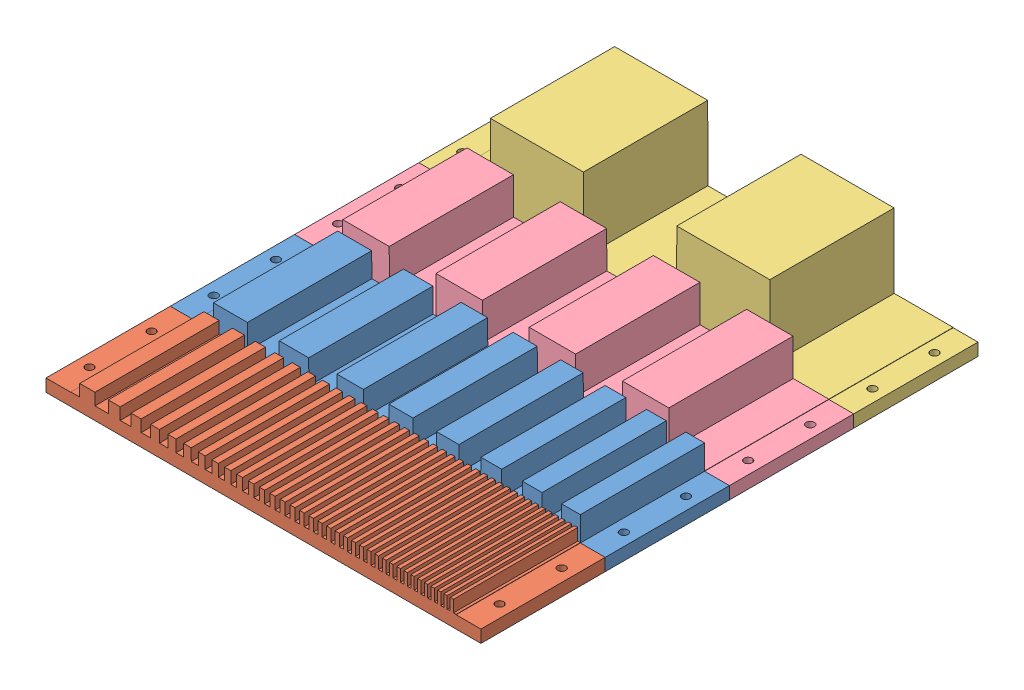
SolidWorks assembly Assem1.sldasm, configuration Default (file format 10000). Lengths in mm.
Overall size (350 69.75 400).
4 component instances, 4 part files, 4 mates.
Components (placement in the parent):
- squareRow3-1: squareRow3.SLDPRT [Default] at (-18.6128 179.592 214.3902) size (350 29.75 100)
- squareRow4-1: squareRow4.SLDPRT [Default] at (-18.6128 179.592 314.3902) size (350 19.75 100)
- squareRow1-1: squareRow1.SLDPRT [Default] at (-18.6128 179.592 14.3902) size (350 69.75 100)
- squareRow2-1: squareRow2.SLDPRT [Default] at (-18.6128 179.592 114.3902) size (350 39.75 100)
Mates (geometry in assembly coordinates):
- Coincident1: coincident anti-aligned: plane of squareRow1-1 through (-18.6128 179.592 114.3902) normal (0 0 1); plane of squareRow2-1 through (-18.6128 179.592 114.3902) normal (0 0 -1)
- Coincident2: coincident: point of squareRow1-1; point of squareRow2-1
- Coincident3: coincident: point of squareRow3-1; point of squareRow2-1
- Coincident4: coincident: point of squareRow3-1; point of squareRow4-1
